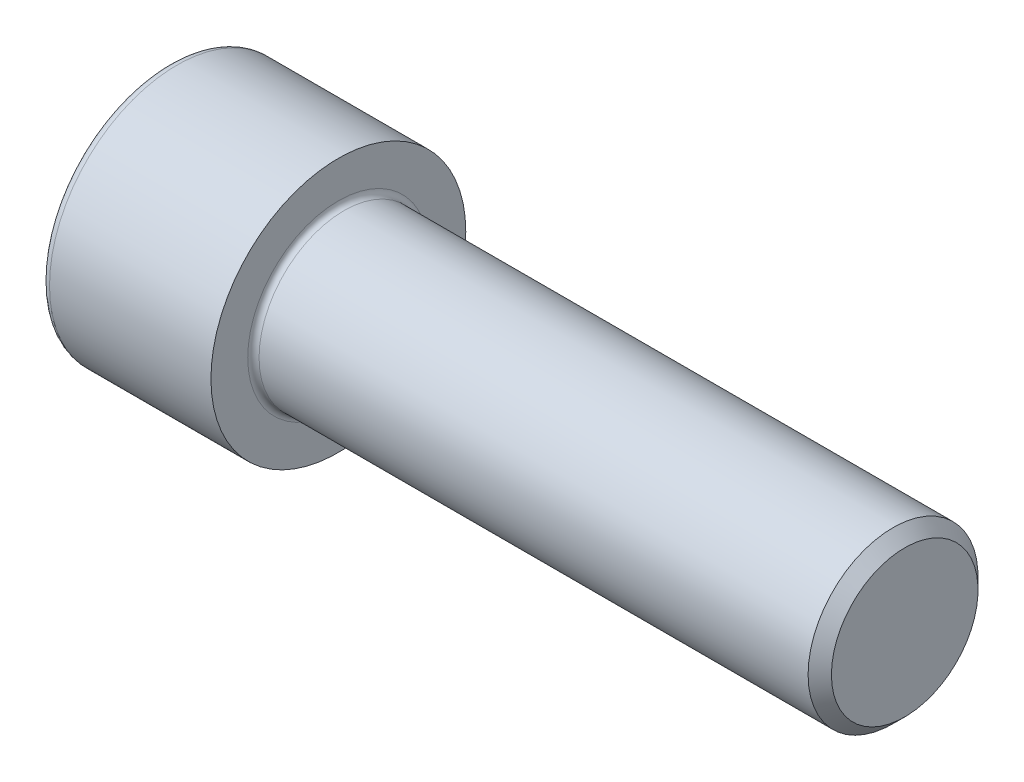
from build123d import *

# Parameters (mm, degrees)
FILLET1_R   = 0.8
FILLET2_R   = 1.2
HEX_2_DEPTH = 12.573


with BuildPart() as part:
    # BodySke → Base-Revolve (revolve)
    with BuildSketch(Plane.XY, mode=Mode.PRIVATE) as base_revolve_sk:
        Polygon((0, 0), (0, 18), (24, 18), (24, 12), (102.352, 12), (104, 10.352), (104, 0), align=None)
    revolve(base_revolve_sk.sketch.rotate(Axis((-31.75, 0, 0), (1, 0, 0)), 90), axis=Axis((-31.75, 0, 0), (1, 0, 0)))

    # Fillet1
    fillet1_edges = [part.edges().sort_by_distance(p)[0] for p in [
        (24, 0, -12),
    ]]
    fillet(fillet1_edges, radius=FILLET1_R)

    # Fillet2
    fillet2_edges = [part.edges().sort_by_distance(p)[0] for p in [
        (0, 0, -18),
    ]]
    fillet(fillet2_edges, radius=FILLET2_R)

    # Sketch2 → Hex-PreBroach (revolve, cut)
    with BuildSketch(Plane.XY, mode=Mode.PRIVATE) as hex_prebroach_sk:
        Polygon((0, 9.6375), (12.573, 9.6375), (18.137213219, 0), (0, 0), align=None)
    revolve(hex_prebroach_sk.sketch.rotate(Axis((0, 0, 0), (1, 0, 0)), 90), axis=Axis((0, 0, 0), (1, 0, 0)), mode=Mode.SUBTRACT)

    # Sketch3 → Hex 2 (cut)
    with BuildSketch(Plane(origin=(0, 0, 0), x_dir=(0, 0.500000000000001, 0.866025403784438), z_dir=(-1, 0, 0))):
        Polygon((5.564213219, 9.6375), (-5.564213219, 9.6375), (-11.128426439, 0), (-5.564213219, -9.6375), (5.564213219, -9.6375), (11.128426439, 0), align=None)
    extrude(amount=-HEX_2_DEPTH, mode=Mode.SUBTRACT)


solid = part.part
